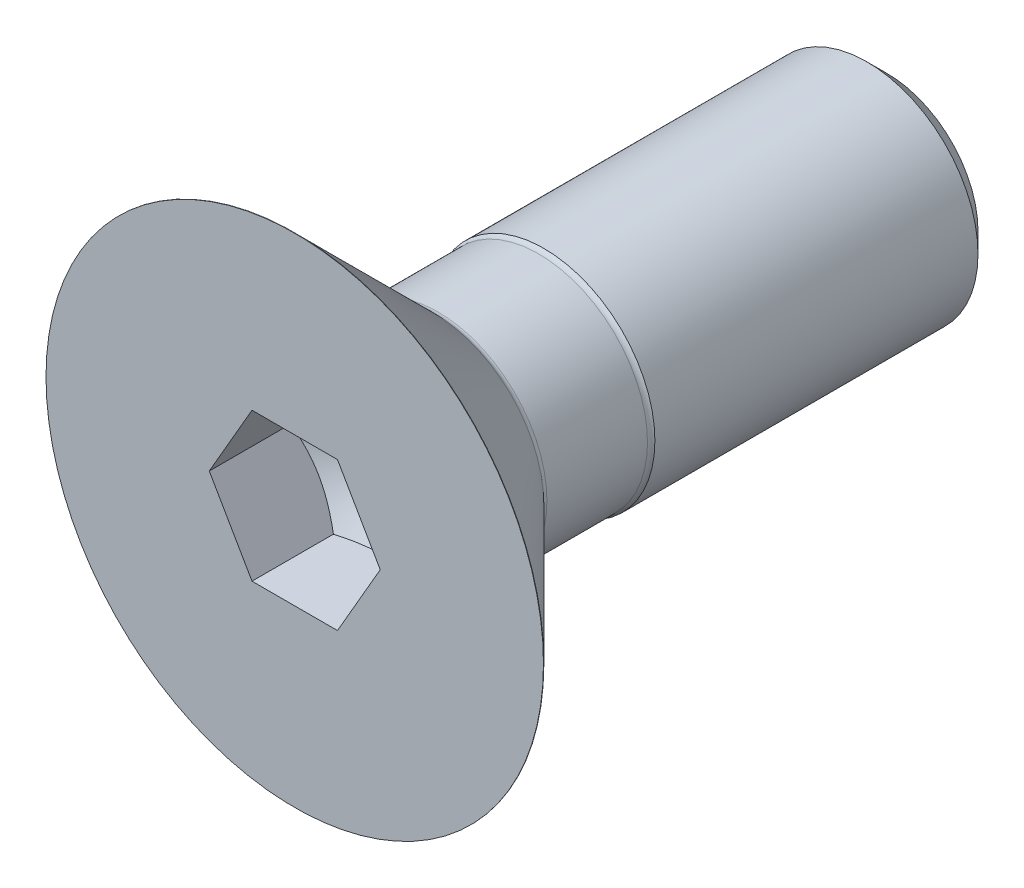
ISO-10303-21;
HEADER;
FILE_DESCRIPTION(('STEP AP214'),'2;1');
FILE_NAME('part.step','',(''),(''),'','','');
FILE_SCHEMA(('AUTOMOTIVE_DESIGN { 1 0 10303 214 1 1 1 1 }'));
ENDSEC;
DATA;
#1=APPLICATION_CONTEXT('core data for automotive mechanical design processes');
#2=APPLICATION_PROTOCOL_DEFINITION('international standard','automotive_design',2000,#1);
#3=PRODUCT_CONTEXT('',#1,'mechanical');
#4=PRODUCT('Part','Part','',(#3));
#5=PRODUCT_RELATED_PRODUCT_CATEGORY('part','',(#4));
#6=PRODUCT_DEFINITION_FORMATION('','',#4);
#7=PRODUCT_DEFINITION_CONTEXT('part definition',#1,'design');
#8=PRODUCT_DEFINITION('design','',#6,#7);
#9=PRODUCT_DEFINITION_SHAPE('','',#8);
#10=(LENGTH_UNIT() NAMED_UNIT(*) SI_UNIT(.MILLI.,.METRE.));
#11=(NAMED_UNIT(*) PLANE_ANGLE_UNIT() SI_UNIT($,.RADIAN.));
#12=(NAMED_UNIT(*) SI_UNIT($,.STERADIAN.) SOLID_ANGLE_UNIT());
#13=UNCERTAINTY_MEASURE_WITH_UNIT(LENGTH_MEASURE(1.E-05),#10,'distance_accuracy_value','');
#14=(GEOMETRIC_REPRESENTATION_CONTEXT(3) GLOBAL_UNCERTAINTY_ASSIGNED_CONTEXT((#13)) GLOBAL_UNIT_ASSIGNED_CONTEXT((#10,
#11,#12)) REPRESENTATION_CONTEXT('',''));
#15=CARTESIAN_POINT('',(0.,0.,0.));
#16=DIRECTION('',(0.,0.,1.));
#17=DIRECTION('',(1.,0.,0.));
#18=AXIS2_PLACEMENT_3D('',#15,#16,#17);
#19=CARTESIAN_POINT('',(0.,6.72,0.));
#20=DIRECTION('',(0.,0.,-1.));
#21=DIRECTION('',(-1.,0.,0.));
#22=AXIS2_PLACEMENT_3D('',#19,#20,#21);
#23=PLANE('',#22);
#24=CARTESIAN_POINT('',(0.,0.,0.));
#25=DIRECTION('',(0.,0.,1.));
#26=DIRECTION('',(1.,0.,0.));
#27=AXIS2_PLACEMENT_3D('',#24,#25,#26);
#28=CIRCLE('',#27,6.72);
#29=CARTESIAN_POINT('',(6.72,0.,0.));
#30=VERTEX_POINT('',#29);
#31=EDGE_CURVE('E106',#30,#30,#28,.T.);
#32=ORIENTED_EDGE('',*,*,#31,.T.);
#33=EDGE_LOOP('',(#32));
#34=FACE_BOUND('',#33,.T.);
#35=DIRECTION('',(0.5,-0.866025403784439,0.));
#36=VECTOR('',#35,1.);
#37=CARTESIAN_POINT('',(1.1547,1.99999906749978,0.));
#38=LINE('',#37,#36);
#39=CARTESIAN_POINT('',(1.1547,1.99999906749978,0.));
#40=VERTEX_POINT('',#39);
#41=CARTESIAN_POINT('',(2.3094,0.,0.));
#42=VERTEX_POINT('',#41);
#43=EDGE_CURVE('E30',#40,#42,#38,.T.);
#44=ORIENTED_EDGE('',*,*,#43,.T.);
#45=DIRECTION('',(-0.5,-0.866025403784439,0.));
#46=VECTOR('',#45,1.);
#47=CARTESIAN_POINT('',(2.3094,0.,0.));
#48=LINE('',#47,#46);
#49=CARTESIAN_POINT('',(1.1547,-1.99999906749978,0.));
#50=VERTEX_POINT('',#49);
#51=EDGE_CURVE('E181',#42,#50,#48,.T.);
#52=ORIENTED_EDGE('',*,*,#51,.T.);
#53=DIRECTION('',(-1.,0.,0.));
#54=VECTOR('',#53,1.);
#55=CARTESIAN_POINT('',(1.1547,-1.99999906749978,0.));
#56=LINE('',#55,#54);
#57=CARTESIAN_POINT('',(-1.1547,-1.99999906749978,0.));
#58=VERTEX_POINT('',#57);
#59=EDGE_CURVE('E233',#50,#58,#56,.T.);
#60=ORIENTED_EDGE('',*,*,#59,.T.);
#61=DIRECTION('',(-0.5,0.866025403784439,0.));
#62=VECTOR('',#61,1.);
#63=CARTESIAN_POINT('',(-1.1547,-1.99999906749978,0.));
#64=LINE('',#63,#62);
#65=CARTESIAN_POINT('',(-2.3094,0.,0.));
#66=VERTEX_POINT('',#65);
#67=EDGE_CURVE('E231',#58,#66,#64,.T.);
#68=ORIENTED_EDGE('',*,*,#67,.T.);
#69=DIRECTION('',(0.5,0.866025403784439,0.));
#70=VECTOR('',#69,1.);
#71=CARTESIAN_POINT('',(-2.3094,0.,0.));
#72=LINE('',#71,#70);
#73=CARTESIAN_POINT('',(-1.1547,1.99999906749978,0.));
#74=VERTEX_POINT('',#73);
#75=EDGE_CURVE('E95',#66,#74,#72,.T.);
#76=ORIENTED_EDGE('',*,*,#75,.T.);
#77=DIRECTION('',(1.,0.,0.));
#78=VECTOR('',#77,1.);
#79=CARTESIAN_POINT('',(-1.1547,1.99999906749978,0.));
#80=LINE('',#79,#78);
#81=EDGE_CURVE('E91',#74,#40,#80,.T.);
#82=ORIENTED_EDGE('',*,*,#81,.T.);
#83=EDGE_LOOP('',(#44,#52,#60,#68,#76,#82));
#84=FACE_BOUND('',#83,.T.);
#85=ADVANCED_FACE('F16',(#34,#84),#23,.F.);
#86=CARTESIAN_POINT('',(0.,0.,-16.));
#87=DIRECTION('',(0.,0.,1.));
#88=DIRECTION('',(1.,0.,0.));
#89=AXIS2_PLACEMENT_3D('',#86,#87,#88);
#90=PLANE('',#89);
#91=CARTESIAN_POINT('',(0.,0.,-16.));
#92=DIRECTION('',(0.,0.,1.));
#93=DIRECTION('',(1.,0.,0.));
#94=AXIS2_PLACEMENT_3D('',#91,#92,#93);
#95=CIRCLE('',#94,2.45875);
#96=CARTESIAN_POINT('',(2.45875,0.,-16.));
#97=VERTEX_POINT('',#96);
#98=EDGE_CURVE('E11',#97,#97,#95,.T.);
#99=ORIENTED_EDGE('',*,*,#98,.F.);
#100=EDGE_LOOP('',(#99));
#101=FACE_BOUND('',#100,.T.);
#102=ADVANCED_FACE('F131',(#101),#90,.F.);
#103=CARTESIAN_POINT('',(0.,0.,-16.));
#104=DIRECTION('',(0.,0.,1.));
#105=DIRECTION('',(1.,0.,0.));
#106=AXIS2_PLACEMENT_3D('',#103,#104,#105);
#107=CONICAL_SURFACE('',#106,2.45875,0.785398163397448);
#108=CARTESIAN_POINT('',(0.,0.,-15.45875));
#109=DIRECTION('',(0.,0.,1.));
#110=DIRECTION('',(1.,0.,0.));
#111=AXIS2_PLACEMENT_3D('',#108,#109,#110);
#112=CIRCLE('',#111,3.);
#113=CARTESIAN_POINT('',(3.,0.,-15.45875));
#114=VERTEX_POINT('',#113);
#115=EDGE_CURVE('E23',#114,#114,#112,.T.);
#116=ORIENTED_EDGE('',*,*,#115,.F.);
#117=EDGE_LOOP('',(#116));
#118=FACE_BOUND('',#117,.T.);
#119=ORIENTED_EDGE('',*,*,#98,.T.);
#120=EDGE_LOOP('',(#119));
#121=FACE_BOUND('',#120,.T.);
#122=ADVANCED_FACE('F128',(#118,#121),#107,.T.);
#123=CARTESIAN_POINT('',(0.,0.,0.));
#124=DIRECTION('',(0.,0.,1.));
#125=DIRECTION('',(1.,0.,0.));
#126=AXIS2_PLACEMENT_3D('',#123,#124,#125);
#127=CYLINDRICAL_SURFACE('',#126,3.);
#128=CARTESIAN_POINT('',(0.,0.,-6.73));
#129=DIRECTION('',(0.,0.,1.));
#130=DIRECTION('',(1.,0.,0.));
#131=AXIS2_PLACEMENT_3D('',#128,#129,#130);
#132=CIRCLE('',#131,3.);
#133=CARTESIAN_POINT('',(3.,0.,-6.73));
#134=VERTEX_POINT('',#133);
#135=EDGE_CURVE('E121',#134,#134,#132,.T.);
#136=ORIENTED_EDGE('',*,*,#135,.F.);
#137=EDGE_LOOP('',(#136));
#138=FACE_BOUND('',#137,.T.);
#139=ORIENTED_EDGE('',*,*,#115,.T.);
#140=EDGE_LOOP('',(#139));
#141=FACE_BOUND('',#140,.T.);
#142=ADVANCED_FACE('F126',(#138,#141),#127,.T.);
#143=CARTESIAN_POINT('',(0.,0.,-6.58857864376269));
#144=DIRECTION('',(0.,0.,1.));
#145=DIRECTION('',(1.,0.,0.));
#146=AXIS2_PLACEMENT_3D('',#143,#144,#145);
#147=TOROIDAL_SURFACE('',#146,3.14142135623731,0.2);
#148=ORIENTED_EDGE('',*,*,#135,.T.);
#149=EDGE_LOOP('',(#148));
#150=FACE_BOUND('',#149,.T.);
#151=CARTESIAN_POINT('',(0.,0.,-6.58857864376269));
#152=DIRECTION('',(0.,0.,1.));
#153=DIRECTION('',(1.,0.,0.));
#154=AXIS2_PLACEMENT_3D('',#151,#152,#153);
#155=CIRCLE('',#154,2.94142135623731);
#156=CARTESIAN_POINT('',(2.94142135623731,0.,-6.58857864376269));
#157=VERTEX_POINT('',#156);
#158=EDGE_CURVE('E118',#157,#157,#155,.T.);
#159=ORIENTED_EDGE('',*,*,#158,.F.);
#160=EDGE_LOOP('',(#159));
#161=FACE_BOUND('',#160,.T.);
#162=ADVANCED_FACE('F145',(#150,#161),#147,.F.);
#163=CARTESIAN_POINT('',(0.,0.,0.));
#164=DIRECTION('',(0.,0.,1.));
#165=DIRECTION('',(1.,0.,0.));
#166=AXIS2_PLACEMENT_3D('',#163,#164,#165);
#167=CYLINDRICAL_SURFACE('',#166,2.94142135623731);
#168=CARTESIAN_POINT('',(0.,0.,-3.87142135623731));
#169=DIRECTION('',(0.,0.,1.));
#170=DIRECTION('',(1.,0.,0.));
#171=AXIS2_PLACEMENT_3D('',#168,#169,#170);
#172=CIRCLE('',#171,2.94142135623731);
#173=CARTESIAN_POINT('',(2.94142135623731,0.,-3.87142135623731));
#174=VERTEX_POINT('',#173);
#175=EDGE_CURVE('E115',#174,#174,#172,.T.);
#176=ORIENTED_EDGE('',*,*,#175,.F.);
#177=EDGE_LOOP('',(#176));
#178=FACE_BOUND('',#177,.T.);
#179=ORIENTED_EDGE('',*,*,#158,.T.);
#180=EDGE_LOOP('',(#179));
#181=FACE_BOUND('',#180,.T.);
#182=ADVANCED_FACE('F149',(#178,#181),#167,.T.);
#183=CARTESIAN_POINT('',(0.,0.,-3.87142135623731));
#184=DIRECTION('',(0.,0.,1.));
#185=DIRECTION('',(1.,0.,0.));
#186=AXIS2_PLACEMENT_3D('',#183,#184,#185);
#187=TOROIDAL_SURFACE('',#186,3.14142135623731,0.2);
#188=ORIENTED_EDGE('',*,*,#175,.T.);
#189=EDGE_LOOP('',(#188));
#190=FACE_BOUND('',#189,.T.);
#191=CARTESIAN_POINT('',(0.,0.,-3.73));
#192=DIRECTION('',(0.,0.,1.));
#193=DIRECTION('',(1.,0.,0.));
#194=AXIS2_PLACEMENT_3D('',#191,#192,#193);
#195=CIRCLE('',#194,3.);
#196=CARTESIAN_POINT('',(3.,0.,-3.73));
#197=VERTEX_POINT('',#196);
#198=EDGE_CURVE('E112',#197,#197,#195,.T.);
#199=ORIENTED_EDGE('',*,*,#198,.F.);
#200=EDGE_LOOP('',(#199));
#201=FACE_BOUND('',#200,.T.);
#202=ADVANCED_FACE('F153',(#190,#201),#187,.F.);
#203=CARTESIAN_POINT('',(0.,0.,-3.73));
#204=DIRECTION('',(0.,0.,1.));
#205=DIRECTION('',(1.,0.,0.));
#206=AXIS2_PLACEMENT_3D('',#203,#204,#205);
#207=CONICAL_SURFACE('',#206,3.,0.785398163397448);
#208=CARTESIAN_POINT('',(0.,0.,-0.0100000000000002));
#209=DIRECTION('',(0.,0.,1.));
#210=DIRECTION('',(1.,0.,0.));
#211=AXIS2_PLACEMENT_3D('',#208,#209,#210);
#212=CIRCLE('',#211,6.72);
#213=CARTESIAN_POINT('',(6.72,0.,-0.00999999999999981));
#214=VERTEX_POINT('',#213);
#215=EDGE_CURVE('E109',#214,#214,#212,.T.);
#216=ORIENTED_EDGE('',*,*,#215,.F.);
#217=EDGE_LOOP('',(#216));
#218=FACE_BOUND('',#217,.T.);
#219=ORIENTED_EDGE('',*,*,#198,.T.);
#220=EDGE_LOOP('',(#219));
#221=FACE_BOUND('',#220,.T.);
#222=ADVANCED_FACE('F157',(#218,#221),#207,.T.);
#223=CARTESIAN_POINT('',(0.,0.,0.));
#224=DIRECTION('',(0.,0.,1.));
#225=DIRECTION('',(1.,0.,0.));
#226=AXIS2_PLACEMENT_3D('',#223,#224,#225);
#227=CYLINDRICAL_SURFACE('',#226,6.72);
#228=ORIENTED_EDGE('',*,*,#31,.F.);
#229=EDGE_LOOP('',(#228));
#230=FACE_BOUND('',#229,.T.);
#231=ORIENTED_EDGE('',*,*,#215,.T.);
#232=EDGE_LOOP('',(#231));
#233=FACE_BOUND('',#232,.T.);
#234=ADVANCED_FACE('F161',(#230,#233),#227,.T.);
#235=CARTESIAN_POINT('',(1.1547,1.99999906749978,-3.53333271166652));
#236=DIRECTION('',(-0.866025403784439,-0.5,0.));
#237=DIRECTION('',(-0.5,0.866025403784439,0.));
#238=AXIS2_PLACEMENT_3D('',#235,#236,#237);
#239=PLANE('',#238);
#240=DIRECTION('',(0.,0.,1.));
#241=VECTOR('',#240,1.);
#242=CARTESIAN_POINT('',(2.3094,0.,-3.53333271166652));
#243=LINE('',#242,#241);
#244=CARTESIAN_POINT('',(2.3094,0.,-2.2));
#245=VERTEX_POINT('',#244);
#246=EDGE_CURVE('E104',#245,#42,#243,.T.);
#247=ORIENTED_EDGE('',*,*,#246,.T.);
#248=ORIENTED_EDGE('',*,*,#43,.F.);
#249=DIRECTION('',(0.,0.,1.));
#250=VECTOR('',#249,1.);
#251=CARTESIAN_POINT('',(1.1547,1.99999906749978,-3.53333271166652));
#252=LINE('',#251,#250);
#253=CARTESIAN_POINT('',(1.1547,1.99999906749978,-2.2));
#254=VERTEX_POINT('',#253);
#255=EDGE_CURVE('E85',#254,#40,#252,.T.);
#256=ORIENTED_EDGE('',*,*,#255,.F.);
#257=CARTESIAN_POINT('',(2.30940011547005,-2.00000000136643E-07,-2.19999993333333));
#258=CARTESIAN_POINT('',(2.25865804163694,0.0878876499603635,-2.22930438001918));
#259=CARTESIAN_POINT('',(2.20747796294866,0.176534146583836,-2.25595524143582));
#260=CARTESIAN_POINT('',(2.10423165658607,0.355361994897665,-2.30247352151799));
#261=CARTESIAN_POINT('',(2.0521635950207,0.445546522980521,-2.32232448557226));
#262=CARTESIAN_POINT('',(1.94867272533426,0.624797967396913,-2.35322394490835));
#263=CARTESIAN_POINT('',(1.89726583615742,0.713837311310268,-2.36447811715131));
#264=CARTESIAN_POINT('',(1.79421029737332,0.892334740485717,-2.37791074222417));
#265=CARTESIAN_POINT('',(1.74256202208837,0.981792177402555,-2.38010032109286));
#266=CARTESIAN_POINT('',(1.64606274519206,1.14893382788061,-2.37553363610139));
#267=CARTESIAN_POINT('',(1.60119726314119,1.2266431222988,-2.36989864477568));
#268=CARTESIAN_POINT('',(1.51175858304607,1.38155546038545,-2.35204263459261));
#269=CARTESIAN_POINT('',(1.46718569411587,1.45875796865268,-2.33981552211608));
#270=CARTESIAN_POINT('',(1.37756276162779,1.61398944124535,-2.30925010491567));
#271=CARTESIAN_POINT('',(1.3325240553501,1.69199876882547,-2.29078229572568));
#272=CARTESIAN_POINT('',(1.2431182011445,1.84685425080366,-2.24886817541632));
#273=CARTESIAN_POINT('',(1.19874990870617,1.92370238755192,-2.22543170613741));
#274=CARTESIAN_POINT('',(1.15469988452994,1.99999926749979,-2.19999993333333));
#275=B_SPLINE_CURVE_WITH_KNOTS('',3,(#257,#258,#259,#260,#261,#262,#263,#264,#265,#266,#267,
#268,#269,#270,#271,#272,#273,#274),.UNSPECIFIED.,.F.,.F.,(4,2,2,2,2,2,2,2,4),(0.,
0.317015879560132,0.634793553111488,0.944707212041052,1.25424036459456,1.52370723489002,
1.79342362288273,2.06912103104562,2.3442773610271),.UNSPECIFIED.);
#276=EDGE_CURVE('E78',#245,#254,#275,.T.);
#277=ORIENTED_EDGE('',*,*,#276,.F.);
#278=EDGE_LOOP('',(#247,#248,#256,#277));
#279=FACE_BOUND('',#278,.T.);
#280=ADVANCED_FACE('F86',(#279),#239,.T.);
#281=CARTESIAN_POINT('',(2.3094,0.,-3.53333271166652));
#282=DIRECTION('',(-0.866025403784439,0.5,0.));
#283=DIRECTION('',(0.5,0.866025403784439,0.));
#284=AXIS2_PLACEMENT_3D('',#281,#282,#283);
#285=PLANE('',#284);
#286=DIRECTION('',(0.,0.,1.));
#287=VECTOR('',#286,1.);
#288=CARTESIAN_POINT('',(1.1547,-1.99999906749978,-3.53333271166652));
#289=LINE('',#288,#287);
#290=CARTESIAN_POINT('',(1.1547,-1.99999906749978,-2.2));
#291=VERTEX_POINT('',#290);
#292=EDGE_CURVE('E102',#291,#50,#289,.T.);
#293=ORIENTED_EDGE('',*,*,#292,.T.);
#294=ORIENTED_EDGE('',*,*,#51,.F.);
#295=ORIENTED_EDGE('',*,*,#246,.F.);
#296=CARTESIAN_POINT('',(1.15469988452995,-1.99999926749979,-2.19999993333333));
#297=CARTESIAN_POINT('',(1.20544195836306,-1.91211141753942,-2.22930438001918));
#298=CARTESIAN_POINT('',(1.25662203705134,-1.82346492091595,-2.25595524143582));
#299=CARTESIAN_POINT('',(1.35986834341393,-1.64463707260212,-2.30247352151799));
#300=CARTESIAN_POINT('',(1.41193640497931,-1.55445254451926,-2.32232448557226));
#301=CARTESIAN_POINT('',(1.51542727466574,-1.37520110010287,-2.35322394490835));
#302=CARTESIAN_POINT('',(1.56683416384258,-1.28616175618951,-2.36447811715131));
#303=CARTESIAN_POINT('',(1.66988970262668,-1.10766432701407,-2.37791074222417));
#304=CARTESIAN_POINT('',(1.72153797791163,-1.01820689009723,-2.38010032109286));
#305=CARTESIAN_POINT('',(1.81803725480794,-0.851065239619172,-2.37553363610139));
#306=CARTESIAN_POINT('',(1.86290273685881,-0.773355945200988,-2.36989864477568));
#307=CARTESIAN_POINT('',(1.95234141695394,-0.618443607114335,-2.35204263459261));
#308=CARTESIAN_POINT('',(1.99691430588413,-0.541241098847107,-2.33981552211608));
#309=CARTESIAN_POINT('',(2.08653723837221,-0.386009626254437,-2.30925010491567));
#310=CARTESIAN_POINT('',(2.1315759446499,-0.308000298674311,-2.29078229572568));
#311=CARTESIAN_POINT('',(2.2209817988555,-0.153144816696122,-2.24886817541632));
#312=CARTESIAN_POINT('',(2.26535009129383,-0.0762966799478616,-2.22543170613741));
#313=CARTESIAN_POINT('',(2.30940011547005,1.99999999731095E-07,-2.19999993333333));
#314=B_SPLINE_CURVE_WITH_KNOTS('',3,(#296,#297,#298,#299,#300,#301,#302,#303,#304,#305,#306,
#307,#308,#309,#310,#311,#312,#313),.UNSPECIFIED.,.F.,.F.,(4,2,2,2,2,2,2,2,4),(0.,
0.317015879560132,0.634793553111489,0.944707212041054,1.25424036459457,1.52370723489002,
1.79342362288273,2.06912103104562,2.3442773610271),.UNSPECIFIED.);
#315=EDGE_CURVE('E82',#291,#245,#314,.T.);
#316=ORIENTED_EDGE('',*,*,#315,.F.);
#317=EDGE_LOOP('',(#293,#294,#295,#316));
#318=FACE_BOUND('',#317,.T.);
#319=ADVANCED_FACE('F169',(#318),#285,.T.);
#320=CARTESIAN_POINT('',(1.1547,-1.99999906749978,-3.53333271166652));
#321=DIRECTION('',(0.,1.,0.));
#322=DIRECTION('',(1.,0.,0.));
#323=AXIS2_PLACEMENT_3D('',#320,#321,#322);
#324=PLANE('',#323);
#325=DIRECTION('',(0.,0.,1.));
#326=VECTOR('',#325,1.);
#327=CARTESIAN_POINT('',(-1.1547,-1.99999906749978,-3.53333271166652));
#328=LINE('',#327,#326);
#329=CARTESIAN_POINT('',(-1.1547,-1.99999906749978,-2.2));
#330=VERTEX_POINT('',#329);
#331=EDGE_CURVE('E100',#330,#58,#328,.T.);
#332=ORIENTED_EDGE('',*,*,#331,.T.);
#333=ORIENTED_EDGE('',*,*,#59,.F.);
#334=ORIENTED_EDGE('',*,*,#292,.F.);
#335=CARTESIAN_POINT('',(-2.99028884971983,-1.99999906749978,-1.45632976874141));
#336=CARTESIAN_POINT('',(-2.90317192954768,-1.99999906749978,-1.49812480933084));
#337=CARTESIAN_POINT('',(-2.81584104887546,-1.99999906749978,-1.53948238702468));
#338=CARTESIAN_POINT('',(-2.64063562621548,-1.99999906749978,-1.6210714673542));
#339=CARTESIAN_POINT('',(-2.55276098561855,-1.99999906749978,-1.66130275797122));
#340=CARTESIAN_POINT('',(-2.3758459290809,-1.99999906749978,-1.74061387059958));
#341=CARTESIAN_POINT('',(-2.28680167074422,-1.99999906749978,-1.77968515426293));
#342=CARTESIAN_POINT('',(-2.10795626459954,-1.99999906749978,-1.8560483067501));
#343=CARTESIAN_POINT('',(-2.01815515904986,-1.99999906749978,-1.89334027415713));
#344=CARTESIAN_POINT('',(-1.83686369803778,-1.99999906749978,-1.96598174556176));
#345=CARTESIAN_POINT('',(-1.74536545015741,-1.99999906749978,-2.00131166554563));
#346=CARTESIAN_POINT('',(-1.56126782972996,-1.99999906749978,-2.06903330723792));
#347=CARTESIAN_POINT('',(-1.46866833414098,-1.99999906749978,-2.10142469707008));
#348=CARTESIAN_POINT('',(-1.28243840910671,-1.99999906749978,-2.16235094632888));
#349=CARTESIAN_POINT('',(-1.18881093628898,-1.99999906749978,-2.19089474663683));
#350=CARTESIAN_POINT('',(-1.00022528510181,-1.99999906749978,-2.24316330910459));
#351=CARTESIAN_POINT('',(-0.905267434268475,-1.99999906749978,-2.2668892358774));
#352=CARTESIAN_POINT('',(-0.71371686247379,-1.99999906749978,-2.30838466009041));
#353=CARTESIAN_POINT('',(-0.617119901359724,-1.99999906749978,-2.3261349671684));
#354=CARTESIAN_POINT('',(-0.422840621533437,-1.99999906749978,-2.3543547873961));
#355=CARTESIAN_POINT('',(-0.325158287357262,-1.99999906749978,-2.36482419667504));
#356=CARTESIAN_POINT('',(-0.129781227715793,-1.99999906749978,-2.37755247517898));
#357=CARTESIAN_POINT('',(-0.0320894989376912,-1.99999906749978,-2.37985598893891));
#358=CARTESIAN_POINT('',(0.163106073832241,-1.99999906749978,-2.37617096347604));
#359=CARTESIAN_POINT('',(0.260609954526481,-1.99999906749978,-2.37018425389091));
#360=CARTESIAN_POINT('',(0.500844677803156,-1.99999906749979,-2.34575235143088));
#361=CARTESIAN_POINT('',(0.643111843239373,-1.99999906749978,-2.32274770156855));
#362=CARTESIAN_POINT('',(0.925045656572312,-1.99999906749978,-2.26338671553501));
#363=CARTESIAN_POINT('',(1.06470522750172,-1.99999906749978,-2.22699840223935));
#364=CARTESIAN_POINT('',(1.27351689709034,-1.99999906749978,-2.16485405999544));
#365=CARTESIAN_POINT('',(1.34375129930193,-1.99999906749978,-2.1426001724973));
#366=CARTESIAN_POINT('',(1.4835379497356,-1.99999906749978,-2.09601824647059));
#367=CARTESIAN_POINT('',(1.55309013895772,-1.99999906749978,-2.07169003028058));
#368=CARTESIAN_POINT('',(1.691168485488,-1.99999906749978,-2.02147021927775));
#369=CARTESIAN_POINT('',(1.75969824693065,-1.99999906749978,-1.99558845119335));
#370=CARTESIAN_POINT('',(1.89618572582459,-1.99999906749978,-1.9424205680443));
#371=CARTESIAN_POINT('',(1.96414362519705,-1.99999906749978,-1.91513492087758));
#372=CARTESIAN_POINT('',(2.03186196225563,-1.99999906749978,-1.88728094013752));
#373=B_SPLINE_CURVE_WITH_KNOTS('',3,(#335,#336,#337,#338,#339,#340,#341,#342,#343,#344,#345,
#346,#347,#348,#349,#350,#351,#352,#353,#354,#355,#356,#357,#358,#359,#360,#361,#362,#363,#364,
#365,#366,#367,#368,#369,#370,#371,#372),.UNSPECIFIED.,.F.,.F.,(4,2,2,2,2,2,2,2,2,2,2,2,2,2,2,2,
2,2,4),(0.,0.289876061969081,0.57980632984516,0.871508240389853,1.16319397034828,
1.45740181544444,1.75164284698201,2.04518789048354,2.33866189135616,2.63306957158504,
2.92748145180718,3.22028122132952,3.513016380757,3.94447373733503,4.37696872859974,
4.59797161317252,4.81899344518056,5.03874045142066,5.25841468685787),.UNSPECIFIED.);
#374=EDGE_CURVE('E206',#330,#291,#373,.T.);
#375=ORIENTED_EDGE('',*,*,#374,.F.);
#376=EDGE_LOOP('',(#332,#333,#334,#375));
#377=FACE_BOUND('',#376,.T.);
#378=ADVANCED_FACE('F210',(#377),#324,.T.);
#379=CARTESIAN_POINT('',(-1.1547,-1.99999906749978,-3.53333271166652));
#380=DIRECTION('',(0.866025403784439,0.5,0.));
#381=DIRECTION('',(0.5,-0.866025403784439,0.));
#382=AXIS2_PLACEMENT_3D('',#379,#380,#381);
#383=PLANE('',#382);
#384=DIRECTION('',(0.,0.,1.));
#385=VECTOR('',#384,1.);
#386=CARTESIAN_POINT('',(-2.3094,0.,-3.53333271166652));
#387=LINE('',#386,#385);
#388=CARTESIAN_POINT('',(-2.3094,0.,-2.2));
#389=VERTEX_POINT('',#388);
#390=EDGE_CURVE('E93',#389,#66,#387,.T.);
#391=ORIENTED_EDGE('',*,*,#390,.T.);
#392=ORIENTED_EDGE('',*,*,#67,.F.);
#393=ORIENTED_EDGE('',*,*,#331,.F.);
#394=CARTESIAN_POINT('',(-2.30940011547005,2.00000000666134E-07,-2.19999993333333));
#395=CARTESIAN_POINT('',(-2.25865804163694,-0.0878876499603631,-2.22930438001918));
#396=CARTESIAN_POINT('',(-2.20747796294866,-0.176534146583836,-2.25595524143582));
#397=CARTESIAN_POINT('',(-2.10423165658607,-0.355361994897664,-2.30247352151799));
#398=CARTESIAN_POINT('',(-2.0521635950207,-0.445546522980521,-2.32232448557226));
#399=CARTESIAN_POINT('',(-1.94867272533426,-0.624797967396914,-2.35322394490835));
#400=CARTESIAN_POINT('',(-1.89726583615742,-0.713837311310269,-2.36447811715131));
#401=CARTESIAN_POINT('',(-1.79421029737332,-0.892334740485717,-2.37791074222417));
#402=CARTESIAN_POINT('',(-1.74256202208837,-0.981792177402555,-2.38010032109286));
#403=CARTESIAN_POINT('',(-1.64606274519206,-1.14893382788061,-2.37553363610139));
#404=CARTESIAN_POINT('',(-1.60119726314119,-1.22664312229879,-2.36989864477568));
#405=CARTESIAN_POINT('',(-1.51175858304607,-1.38155546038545,-2.35204263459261));
#406=CARTESIAN_POINT('',(-1.46718569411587,-1.45875796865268,-2.33981552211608));
#407=CARTESIAN_POINT('',(-1.37756276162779,-1.61398944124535,-2.30925010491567));
#408=CARTESIAN_POINT('',(-1.3325240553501,-1.69199876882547,-2.29078229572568));
#409=CARTESIAN_POINT('',(-1.2431182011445,-1.84685425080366,-2.24886817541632));
#410=CARTESIAN_POINT('',(-1.19874990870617,-1.92370238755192,-2.22543170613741));
#411=CARTESIAN_POINT('',(-1.15469988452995,-1.99999926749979,-2.19999993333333));
#412=B_SPLINE_CURVE_WITH_KNOTS('',3,(#394,#395,#396,#397,#398,#399,#400,#401,#402,#403,#404,
#405,#406,#407,#408,#409,#410,#411),.UNSPECIFIED.,.F.,.F.,(4,2,2,2,2,2,2,2,4),(0.,
0.317015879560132,0.634793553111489,0.944707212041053,1.25424036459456,1.52370723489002,
1.79342362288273,2.06912103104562,2.3442773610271),.UNSPECIFIED.);
#413=EDGE_CURVE('E201',#389,#330,#412,.T.);
#414=ORIENTED_EDGE('',*,*,#413,.F.);
#415=EDGE_LOOP('',(#391,#392,#393,#414));
#416=FACE_BOUND('',#415,.T.);
#417=ADVANCED_FACE('F213',(#416),#383,.T.);
#418=CARTESIAN_POINT('',(-2.3094,0.,-3.53333271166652));
#419=DIRECTION('',(0.866025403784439,-0.5,0.));
#420=DIRECTION('',(-0.5,-0.866025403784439,0.));
#421=AXIS2_PLACEMENT_3D('',#418,#419,#420);
#422=PLANE('',#421);
#423=DIRECTION('',(0.,0.,1.));
#424=VECTOR('',#423,1.);
#425=CARTESIAN_POINT('',(-1.1547,1.99999906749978,-3.53333271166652));
#426=LINE('',#425,#424);
#427=CARTESIAN_POINT('',(-1.1547,1.99999906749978,-2.2));
#428=VERTEX_POINT('',#427);
#429=EDGE_CURVE('E90',#428,#74,#426,.T.);
#430=ORIENTED_EDGE('',*,*,#429,.T.);
#431=ORIENTED_EDGE('',*,*,#75,.F.);
#432=ORIENTED_EDGE('',*,*,#390,.F.);
#433=CARTESIAN_POINT('',(-1.15469988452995,1.99999926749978,-2.19999993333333));
#434=CARTESIAN_POINT('',(-1.20544195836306,1.91211141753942,-2.22930438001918));
#435=CARTESIAN_POINT('',(-1.25662203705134,1.82346492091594,-2.25595524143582));
#436=CARTESIAN_POINT('',(-1.35986834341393,1.64463707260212,-2.30247352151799));
#437=CARTESIAN_POINT('',(-1.41193640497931,1.55445254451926,-2.32232448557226));
#438=CARTESIAN_POINT('',(-1.51542727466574,1.37520110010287,-2.35322394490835));
#439=CARTESIAN_POINT('',(-1.56683416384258,1.28616175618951,-2.36447811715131));
#440=CARTESIAN_POINT('',(-1.66988970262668,1.10766432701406,-2.37791074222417));
#441=CARTESIAN_POINT('',(-1.72153797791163,1.01820689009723,-2.38010032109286));
#442=CARTESIAN_POINT('',(-1.81803725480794,0.851065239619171,-2.37553363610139));
#443=CARTESIAN_POINT('',(-1.86290273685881,0.773355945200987,-2.36989864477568));
#444=CARTESIAN_POINT('',(-1.95234141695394,0.618443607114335,-2.35204263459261));
#445=CARTESIAN_POINT('',(-1.99691430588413,0.541241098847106,-2.33981552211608));
#446=CARTESIAN_POINT('',(-2.08653723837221,0.386009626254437,-2.30925010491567));
#447=CARTESIAN_POINT('',(-2.1315759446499,0.308000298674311,-2.29078229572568));
#448=CARTESIAN_POINT('',(-2.2209817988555,0.153144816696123,-2.24886817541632));
#449=CARTESIAN_POINT('',(-2.26535009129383,0.0762966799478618,-2.22543170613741));
#450=CARTESIAN_POINT('',(-2.30940011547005,-1.99999999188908E-07,-2.19999993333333));
#451=B_SPLINE_CURVE_WITH_KNOTS('',3,(#433,#434,#435,#436,#437,#438,#439,#440,#441,#442,#443,
#444,#445,#446,#447,#448,#449,#450),.UNSPECIFIED.,.F.,.F.,(4,2,2,2,2,2,2,2,4),(0.,
0.317015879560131,0.634793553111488,0.944707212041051,1.25424036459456,1.52370723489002,
1.79342362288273,2.06912103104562,2.34427736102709),.UNSPECIFIED.);
#452=EDGE_CURVE('E38',#428,#389,#451,.T.);
#453=ORIENTED_EDGE('',*,*,#452,.F.);
#454=EDGE_LOOP('',(#430,#431,#432,#453));
#455=FACE_BOUND('',#454,.T.);
#456=ADVANCED_FACE('F217',(#455),#422,.T.);
#457=CARTESIAN_POINT('',(-1.1547,1.99999906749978,-3.53333271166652));
#458=DIRECTION('',(0.,-1.,0.));
#459=DIRECTION('',(-1.,0.,0.));
#460=AXIS2_PLACEMENT_3D('',#457,#458,#459);
#461=PLANE('',#460);
#462=ORIENTED_EDGE('',*,*,#255,.T.);
#463=ORIENTED_EDGE('',*,*,#81,.F.);
#464=ORIENTED_EDGE('',*,*,#429,.F.);
#465=CARTESIAN_POINT('',(-2.99028884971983,1.99999906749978,-1.45632976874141));
#466=CARTESIAN_POINT('',(-2.90317192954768,1.99999906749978,-1.49812480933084));
#467=CARTESIAN_POINT('',(-2.81584104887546,1.99999906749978,-1.53948238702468));
#468=CARTESIAN_POINT('',(-2.64063562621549,1.99999906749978,-1.6210714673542));
#469=CARTESIAN_POINT('',(-2.55276098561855,1.99999906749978,-1.66130275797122));
#470=CARTESIAN_POINT('',(-2.3758459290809,1.99999906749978,-1.74061387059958));
#471=CARTESIAN_POINT('',(-2.28680167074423,1.99999906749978,-1.77968515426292));
#472=CARTESIAN_POINT('',(-2.10795626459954,1.99999906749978,-1.8560483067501));
#473=CARTESIAN_POINT('',(-2.01815515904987,1.99999906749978,-1.89334027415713));
#474=CARTESIAN_POINT('',(-1.83686369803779,1.99999906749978,-1.96598174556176));
#475=CARTESIAN_POINT('',(-1.74536545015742,1.99999906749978,-2.00131166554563));
#476=CARTESIAN_POINT('',(-1.56126782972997,1.99999906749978,-2.06903330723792));
#477=CARTESIAN_POINT('',(-1.46866833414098,1.99999906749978,-2.10142469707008));
#478=CARTESIAN_POINT('',(-1.28243840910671,1.99999906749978,-2.16235094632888));
#479=CARTESIAN_POINT('',(-1.18881093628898,1.99999906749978,-2.19089474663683));
#480=CARTESIAN_POINT('',(-1.00022528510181,1.99999906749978,-2.24316330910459));
#481=CARTESIAN_POINT('',(-0.905267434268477,1.99999906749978,-2.2668892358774));
#482=CARTESIAN_POINT('',(-0.713716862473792,1.99999906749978,-2.30838466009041));
#483=CARTESIAN_POINT('',(-0.617119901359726,1.99999906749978,-2.3261349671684));
#484=CARTESIAN_POINT('',(-0.422840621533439,1.99999906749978,-2.3543547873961));
#485=CARTESIAN_POINT('',(-0.325158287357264,1.99999906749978,-2.36482419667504));
#486=CARTESIAN_POINT('',(-0.129781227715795,1.99999906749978,-2.37755247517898));
#487=CARTESIAN_POINT('',(-0.032089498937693,1.99999906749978,-2.37985598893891));
#488=CARTESIAN_POINT('',(0.16310607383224,1.99999906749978,-2.37617096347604));
#489=CARTESIAN_POINT('',(0.26060995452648,1.99999906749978,-2.37018425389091));
#490=CARTESIAN_POINT('',(0.500844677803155,1.99999906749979,-2.34575235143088));
#491=CARTESIAN_POINT('',(0.643111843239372,1.99999906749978,-2.32274770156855));
#492=CARTESIAN_POINT('',(0.925045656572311,1.99999906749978,-2.26338671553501));
#493=CARTESIAN_POINT('',(1.06470522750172,1.99999906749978,-2.22699840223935));
#494=CARTESIAN_POINT('',(1.27351689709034,1.99999906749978,-2.16485405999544));
#495=CARTESIAN_POINT('',(1.34375129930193,1.99999906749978,-2.1426001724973));
#496=CARTESIAN_POINT('',(1.48353794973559,1.99999906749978,-2.09601824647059));
#497=CARTESIAN_POINT('',(1.55309013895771,1.99999906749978,-2.07169003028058));
#498=CARTESIAN_POINT('',(1.691168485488,1.99999906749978,-2.02147021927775));
#499=CARTESIAN_POINT('',(1.75969824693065,1.99999906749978,-1.99558845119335));
#500=CARTESIAN_POINT('',(1.89618572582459,1.99999906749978,-1.9424205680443));
#501=CARTESIAN_POINT('',(1.96414362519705,1.99999906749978,-1.91513492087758));
#502=CARTESIAN_POINT('',(2.03186196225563,1.99999906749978,-1.88728094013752));
#503=B_SPLINE_CURVE_WITH_KNOTS('',3,(#465,#466,#467,#468,#469,#470,#471,#472,#473,#474,#475,
#476,#477,#478,#479,#480,#481,#482,#483,#484,#485,#486,#487,#488,#489,#490,#491,#492,#493,#494,
#495,#496,#497,#498,#499,#500,#501,#502),.UNSPECIFIED.,.F.,.F.,(4,2,2,2,2,2,2,2,2,2,2,2,2,2,2,2,
2,2,4),(0.,0.28987606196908,0.579806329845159,0.871508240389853,1.16319397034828,
1.45740181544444,1.75164284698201,2.04518789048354,2.33866189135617,2.63306957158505,
2.92748145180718,3.22028122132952,3.513016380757,3.94447373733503,4.37696872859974,
4.59797161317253,4.81899344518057,5.03874045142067,5.25841468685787),.UNSPECIFIED.);
#504=EDGE_CURVE('E79',#254,#428,#503,.F.);
#505=ORIENTED_EDGE('',*,*,#504,.F.);
#506=EDGE_LOOP('',(#462,#463,#464,#505));
#507=FACE_BOUND('',#506,.T.);
#508=ADVANCED_FACE('F74',(#507),#461,.T.);
#509=CARTESIAN_POINT('',(0.,0.,-3.53333271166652));
#510=DIRECTION('',(0.,0.,1.));
#511=DIRECTION('',(1.,0.,0.));
#512=AXIS2_PLACEMENT_3D('',#509,#510,#511);
#513=CONICAL_SURFACE('',#512,0.,1.0471975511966);
#514=CARTESIAN_POINT('',(0.,0.,-3.53333271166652));
#515=VERTEX_POINT('',#514);
#516=VERTEX_LOOP('',#515);
#517=FACE_BOUND('',#516,.T.);
#518=ORIENTED_EDGE('',*,*,#276,.T.);
#519=ORIENTED_EDGE('',*,*,#504,.T.);
#520=ORIENTED_EDGE('',*,*,#452,.T.);
#521=ORIENTED_EDGE('',*,*,#413,.T.);
#522=ORIENTED_EDGE('',*,*,#374,.T.);
#523=ORIENTED_EDGE('',*,*,#315,.T.);
#524=EDGE_LOOP('',(#518,#519,#520,#521,#522,#523));
#525=FACE_BOUND('',#524,.T.);
#526=ADVANCED_FACE('F71',(#517,#525),#513,.F.);
#527=CLOSED_SHELL('',(#85,#102,#122,#142,#162,#182,#202,#222,#234,#280,#319,#378,#417,#456,#508,#526));
#528=MANIFOLD_SOLID_BREP('B1',#527);
#529=ADVANCED_BREP_SHAPE_REPRESENTATION('',(#18,#528),#14);
#530=SHAPE_DEFINITION_REPRESENTATION(#9,#529);
ENDSEC;
END-ISO-10303-21;
